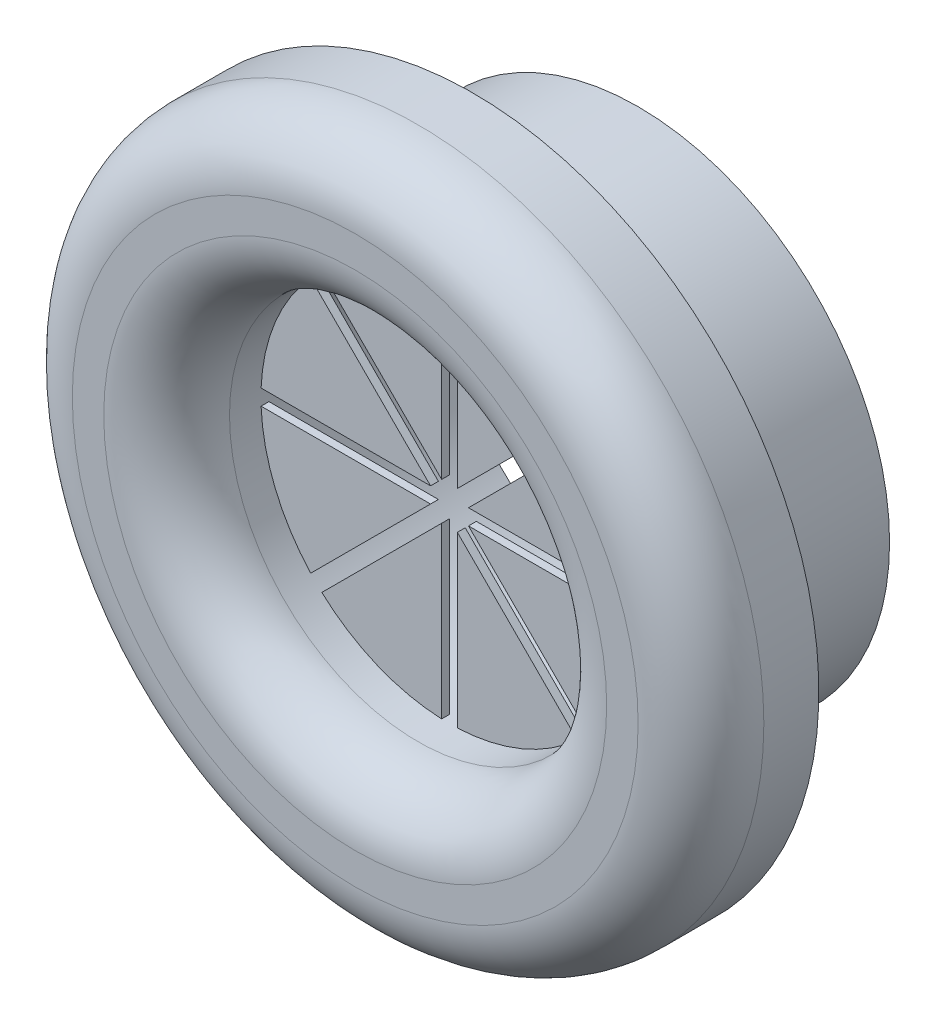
from build123d import *

# Parameters (mm, degrees)
SZKIC1_R                    = 8
DODANIE_WYCI_GNI_CIE1_DEPTH = 5
SZKIC2_R                    = 11
DODANIE_WYCI_GNI_CIE2_DEPTH = 4
SZKIC3_R                    = 6
WYTNIJ_WYCI_GNI_CIE1_DEPTH  = 18.972200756
ZAOKR_GLENIE1_R             = 2
DODANIE_WYCI_GNI_CIE3_DEPTH = 0.25
SZYK_KO_OWY1_COUNT          = 8
SZKIC5_R                    = 11
SZKIC5_R_2                  = 10
WYTNIJ_WYCI_GNI_CIE2_DEPTH  = 0.25


with BuildPart() as part:
    # Szkic1 → Dodanie-wyci_gni_cie1 (new body)
    with BuildSketch(Plane.XY):
        Circle(SZKIC1_R)
    extrude(amount=DODANIE_WYCI_GNI_CIE1_DEPTH)

    # Szkic2 → Dodanie-wyci_gni_cie2 (add)
    with BuildSketch(Plane.XY.offset(5)):
        Circle(SZKIC2_R)
    extrude(amount=DODANIE_WYCI_GNI_CIE2_DEPTH)

    # Szkic3 → Wytnij-wyci_gni_cie1 (cut, through all)
    with BuildSketch(Plane.XY.offset(9)):
        Circle(SZKIC3_R)
    extrude(amount=-WYTNIJ_WYCI_GNI_CIE1_DEPTH, mode=Mode.SUBTRACT)

    # Zaokr_glenie1
    zaokr_glenie1_edges = [part.edges().sort_by_distance(p)[0] for p in [
        (-6, 0, 9),
        (-11, 0, 9),
    ]]
    fillet(zaokr_glenie1_edges, radius=ZAOKR_GLENIE1_R)

    # Szkic4 → Dodanie-wyci_gni_cie3 (add)
    with BuildSketch(Plane(origin=(0, 0, 6), x_dir=(-1, 0, 0), z_dir=(0, 0, -1))):
        with BuildLine():
            Line((4.415732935, -4.062179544), (0.603553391, -0.25))
            Line((0.603553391, -0.25), (5.994789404, -0.25))
            ThreePointArc((5.994789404, -0.25), (5.543277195, -2.296100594), (4.415732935, -4.062179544))
        make_face()
    dodanie_wyci_gni_cie3 = extrude(amount=DODANIE_WYCI_GNI_CIE3_DEPTH)

    # Szyk ko_owy1: Dodanie-wyci_gni_cie3 ×8 about axis
    szyk_ko_owy1_axis = Axis((0, 0, 0), (0, 0, 1))
    for i in range(1, SZYK_KO_OWY1_COUNT):
        add(dodanie_wyci_gni_cie3.rotate(szyk_ko_owy1_axis, i * 360 / SZYK_KO_OWY1_COUNT))

    # Szkic5 → Wytnij-wyci_gni_cie2 (cut)
    with BuildSketch(Plane(origin=(0, 0, 5), x_dir=(-1, 0, 0), z_dir=(0, 0, -1))):
        Circle(SZKIC5_R)
        Circle(SZKIC5_R_2, mode=Mode.SUBTRACT)
    extrude(amount=-WYTNIJ_WYCI_GNI_CIE2_DEPTH, mode=Mode.SUBTRACT)


solid = part.part
